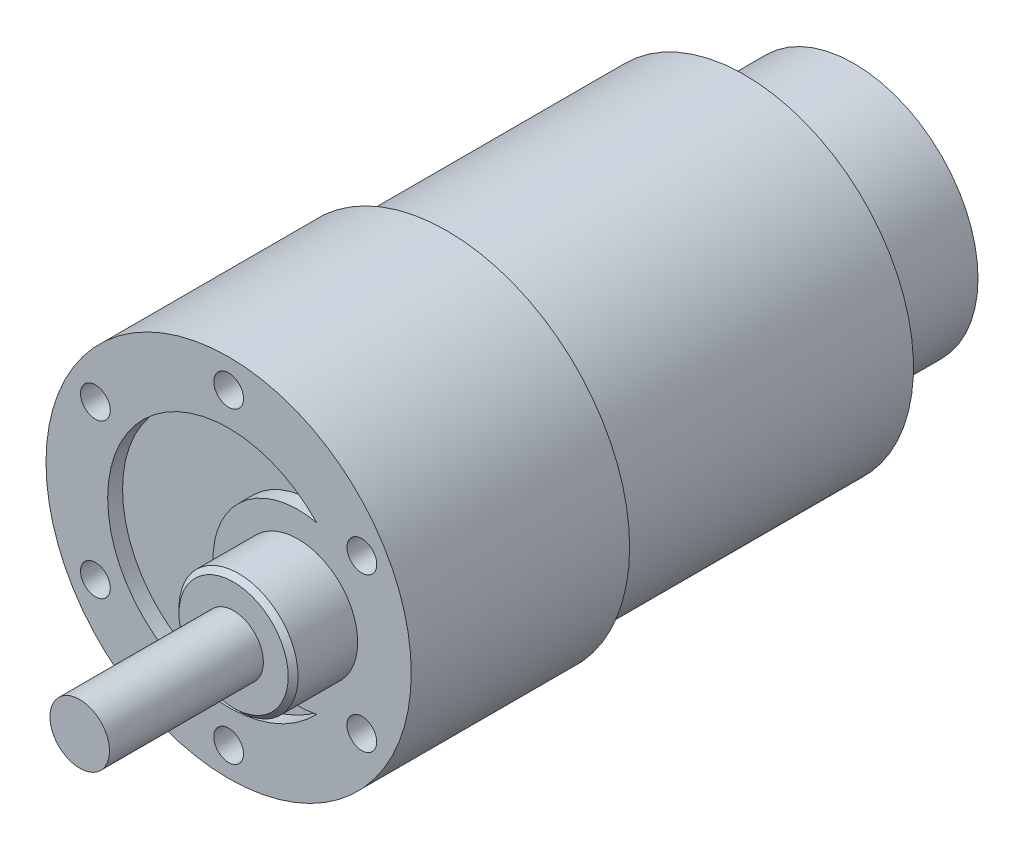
from build123d import *

# Parameters (mm, degrees)
SKETCH2_R                    = 17
BOSS_EXTRUDE1_DEPTH          = 29
SKETCH3_R                    = 12.5
BOSS_EXTRUDE2_DEPTH          = 11
CUT_EXTRUDE1_DEPTH           = 1.5
F_3_0_3_DIAMETER_HOLE1_D     = 3
F_3_0_3_DIAMETER_HOLE1_DEPTH = 3
CHAMFER1_SIZE                = 0.5


with BuildPart() as part:
    # Sketch1 → Revolve1 (revolve)
    with BuildSketch(Plane.XZ, mode=Mode.PRIVATE) as revolve1_sk:
        with BuildLine():
            Line((18.4, 52), (0, 52))
            Line((0, 52), (0, 29))
            Line((0, 29), (17, 29))
            ThreePointArc((17, 29), (16.707106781, 29.707106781), (16, 30))
            Line((16, 30), (18.4, 30))
            Line((18.4, 30), (18.4, 52))
        make_face()
    revolve(revolve1_sk.sketch.rotate(Axis((0, 0, 52), (0, 0, -1)), 180), axis=Axis((0, 0, 52), (0, 0, -1)))

    # Sketch2 → Boss-Extrude1 (add)
    with BuildSketch(Plane(origin=(0, 0, 29), x_dir=(-1, 0, 0), z_dir=(0, 0, -1))):
        Circle(SKETCH2_R)
    extrude(amount=BOSS_EXTRUDE1_DEPTH)

    # Sketch3 → Boss-Extrude2 (add)
    with BuildSketch(Plane(origin=(0, 0, 0), x_dir=(-1, 0, 0), z_dir=(0, 0, -1))):
        Circle(SKETCH3_R)
    extrude(amount=BOSS_EXTRUDE2_DEPTH)

    # Sketch4 → Cut-Extrude1 (cut)
    with BuildSketch(Plane.XY.offset(52)):
        with BuildLine():
            ThreePointArc((8.868134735, 8.359715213), (-12.187233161, 0), (8.868134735, -8.359715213))
            ThreePointArc((8.868134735, -8.359715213), (-1.565907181, 0), (8.868134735, 8.359715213))
        make_face()
    extrude(amount=-CUT_EXTRUDE1_DEPTH, mode=Mode.SUBTRACT)

    # Sketch5 → Revolve2 (revolve)
    with BuildSketch(Plane.XZ, mode=Mode.PRIVATE) as revolve2_sk:
        Polygon((10, 74), (7, 74), (7, 52), (13, 52), (13, 58.5), (10, 58.5), align=None)
    revolve(revolve2_sk.sketch.rotate(Axis((7, 0, 74), (0, 0, -1)), 180), axis=Axis((7, 0, 74), (0, 0, -1)))

    # 3.0 _3_ Diameter Hole1
    with Locations(Plane.XY.offset(52)):
        with Locations((-13.423393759, 7.75), (-13.423393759, -7.75), (0, -15.5), (13.423393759, -7.75), (13.423393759, 7.75), (0, 15.5)):
            Hole(F_3_0_3_DIAMETER_HOLE1_D / 2, depth=F_3_0_3_DIAMETER_HOLE1_DEPTH)

    # Chamfer1
    chamfer1_edges = [part.edges().sort_by_distance(p)[0] for p in [
        (13, 0, 58.5),
    ]]
    chamfer(chamfer1_edges, length=CHAMFER1_SIZE)


solid = part.part
